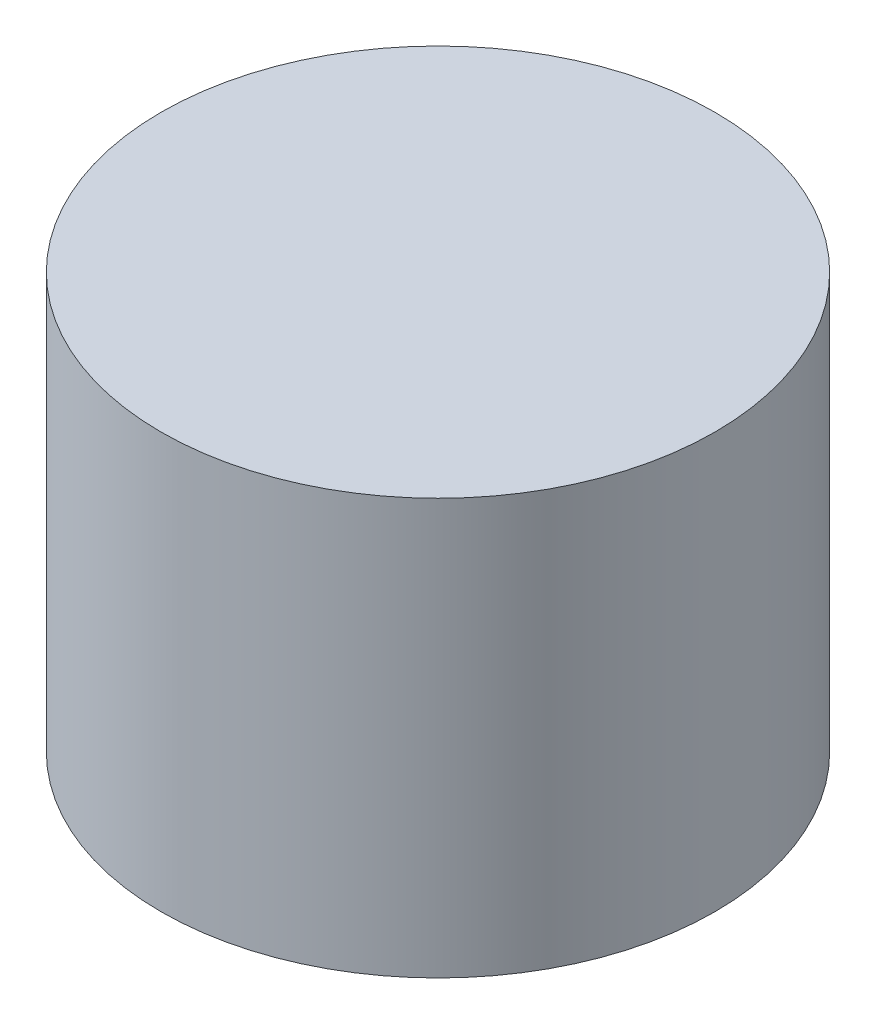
from build123d import *

# Parameters (mm, degrees)
SKETCH1_R      = 4
EXTRUDE1_DEPTH = 6


with BuildPart() as part:
    # Sketch1 → Extrude1 (new body)
    with BuildSketch(Plane(origin=(0, 0, 0), x_dir=(1, 0, 0), z_dir=(0, 1, 0))):
        with Locations(Location((0, 0, 0), (0, 0, 270))):
            Circle(SKETCH1_R)
    extrude(amount=EXTRUDE1_DEPTH)


solid = part.part
